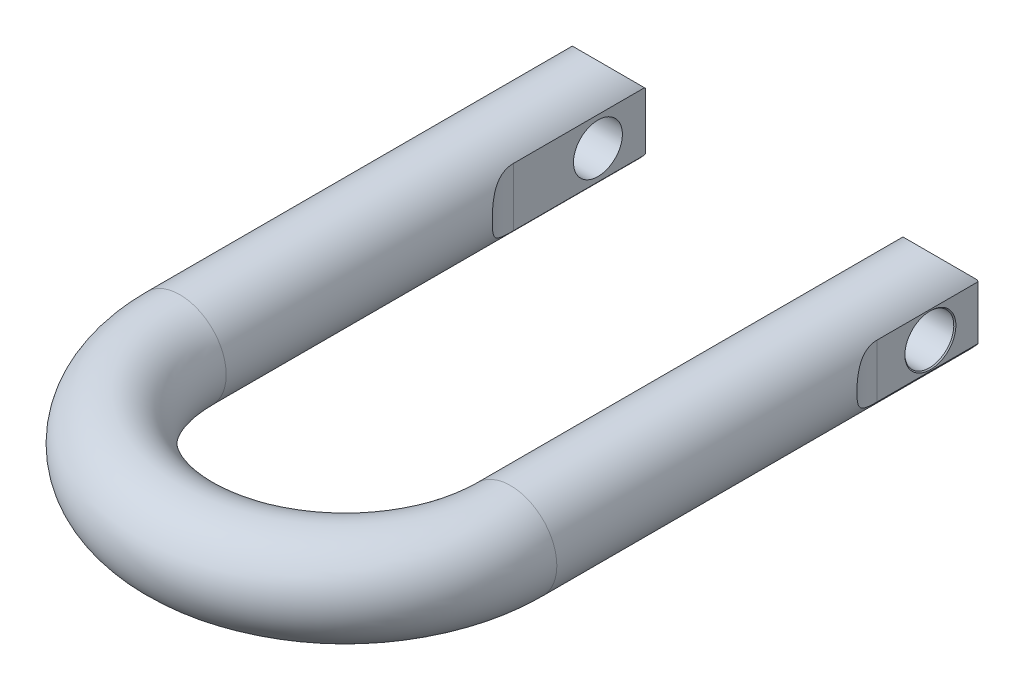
ISO-10303-21;
HEADER;
FILE_DESCRIPTION(('STEP AP214'),'2;1');
FILE_NAME('part.step','',(''),(''),'','','');
FILE_SCHEMA(('AUTOMOTIVE_DESIGN { 1 0 10303 214 1 1 1 1 }'));
ENDSEC;
DATA;
#1=APPLICATION_CONTEXT('core data for automotive mechanical design processes');
#2=APPLICATION_PROTOCOL_DEFINITION('international standard','automotive_design',2000,#1);
#3=PRODUCT_CONTEXT('',#1,'mechanical');
#4=PRODUCT('Part','Part','',(#3));
#5=PRODUCT_RELATED_PRODUCT_CATEGORY('part','',(#4));
#6=PRODUCT_DEFINITION_FORMATION('','',#4);
#7=PRODUCT_DEFINITION_CONTEXT('part definition',#1,'design');
#8=PRODUCT_DEFINITION('design','',#6,#7);
#9=PRODUCT_DEFINITION_SHAPE('','',#8);
#10=(LENGTH_UNIT() NAMED_UNIT(*) SI_UNIT(.MILLI.,.METRE.));
#11=(NAMED_UNIT(*) PLANE_ANGLE_UNIT() SI_UNIT($,.RADIAN.));
#12=(NAMED_UNIT(*) SI_UNIT($,.STERADIAN.) SOLID_ANGLE_UNIT());
#13=UNCERTAINTY_MEASURE_WITH_UNIT(LENGTH_MEASURE(1.E-05),#10,'distance_accuracy_value','');
#14=(GEOMETRIC_REPRESENTATION_CONTEXT(3) GLOBAL_UNCERTAINTY_ASSIGNED_CONTEXT((#13)) GLOBAL_UNIT_ASSIGNED_CONTEXT((#10,
#11,#12)) REPRESENTATION_CONTEXT('',''));
#15=CARTESIAN_POINT('',(0.,0.,0.));
#16=DIRECTION('',(0.,0.,1.));
#17=DIRECTION('',(1.,0.,0.));
#18=AXIS2_PLACEMENT_3D('',#15,#16,#17);
#19=CARTESIAN_POINT('',(97.5106,0.,0.));
#20=DIRECTION('',(1.,0.,0.));
#21=DIRECTION('',(0.,1.,0.));
#22=AXIS2_PLACEMENT_3D('',#19,#20,#21);
#23=CONICAL_SURFACE('',#22,12.2555,0.785398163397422);
#24=CARTESIAN_POINT('',(97.0051,0.,0.));
#25=DIRECTION('',(1.,0.,0.));
#26=DIRECTION('',(0.,1.,0.));
#27=AXIS2_PLACEMENT_3D('',#24,#25,#26);
#28=CIRCLE('',#27,11.75);
#29=CARTESIAN_POINT('',(97.0051,11.75,0.));
#30=VERTEX_POINT('',#29);
#31=EDGE_CURVE('E107',#30,#30,#28,.F.);
#32=ORIENTED_EDGE('',*,*,#31,.T.);
#33=EDGE_LOOP('',(#32));
#34=FACE_BOUND('',#33,.T.);
#35=CARTESIAN_POINT('',(97.5106,0.,0.));
#36=DIRECTION('',(1.,0.,0.));
#37=DIRECTION('',(0.,1.,0.));
#38=AXIS2_PLACEMENT_3D('',#35,#36,#37);
#39=CIRCLE('',#38,12.2555);
#40=CARTESIAN_POINT('',(97.5106,12.2555,0.));
#41=VERTEX_POINT('',#40);
#42=EDGE_CURVE('E116',#41,#41,#39,.T.);
#43=ORIENTED_EDGE('',*,*,#42,.T.);
#44=EDGE_LOOP('',(#43));
#45=FACE_BOUND('',#44,.T.);
#46=ADVANCED_FACE('F14',(#34,#45),#23,.F.);
#47=CARTESIAN_POINT('',(79.3877,0.,-22.8727));
#48=DIRECTION('',(0.,0.,1.));
#49=DIRECTION('',(-1.,0.,0.));
#50=AXIS2_PLACEMENT_3D('',#47,#48,#49);
#51=PLANE('',#50);
#52=DIRECTION('',(0.,-1.,0.));
#53=VECTOR('',#52,1.);
#54=CARTESIAN_POINT('',(97.5106,38.0238,-22.8727));
#55=LINE('',#54,#53);
#56=CARTESIAN_POINT('',(97.5106,12.8651125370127,-22.8727));
#57=VERTEX_POINT('',#56);
#58=CARTESIAN_POINT('',(97.5106,-12.8651125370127,-22.8727));
#59=VERTEX_POINT('',#58);
#60=EDGE_CURVE('E109',#57,#59,#55,.T.);
#61=ORIENTED_EDGE('',*,*,#60,.T.);
#62=CARTESIAN_POINT('',(79.3877,0.,-22.8727));
#63=DIRECTION('',(0.,0.,-1.));
#64=DIRECTION('',(1.,0.,0.));
#65=AXIS2_PLACEMENT_3D('',#62,#63,#64);
#66=CIRCLE('',#65,22.225);
#67=CARTESIAN_POINT('',(97.0475226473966,-13.49375,-22.8727));
#68=VERTEX_POINT('',#67);
#69=EDGE_CURVE('E95',#68,#59,#66,.F.);
#70=ORIENTED_EDGE('',*,*,#69,.F.);
#71=DIRECTION('',(1.,0.,0.));
#72=VECTOR('',#71,1.);
#73=CARTESIAN_POINT('',(-135.3312,-13.49375,-22.8727));
#74=LINE('',#73,#72);
#75=CARTESIAN_POINT('',(62.1284,-13.49375,-22.8727));
#76=VERTEX_POINT('',#75);
#77=EDGE_CURVE('E142',#68,#76,#74,.F.);
#78=ORIENTED_EDGE('',*,*,#77,.T.);
#79=DIRECTION('',(0.,-1.,0.));
#80=VECTOR('',#79,1.);
#81=CARTESIAN_POINT('',(62.1284,38.0238,-22.8727));
#82=LINE('',#81,#80);
#83=CARTESIAN_POINT('',(62.1284,13.49375,-22.8727));
#84=VERTEX_POINT('',#83);
#85=EDGE_CURVE('E152',#76,#84,#82,.F.);
#86=ORIENTED_EDGE('',*,*,#85,.T.);
#87=DIRECTION('',(1.,0.,0.));
#88=VECTOR('',#87,1.);
#89=CARTESIAN_POINT('',(-135.3312,13.49375,-22.8727));
#90=LINE('',#89,#88);
#91=CARTESIAN_POINT('',(97.0475226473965,13.49375,-22.8727));
#92=VERTEX_POINT('',#91);
#93=EDGE_CURVE('E155',#84,#92,#90,.T.);
#94=ORIENTED_EDGE('',*,*,#93,.T.);
#95=CARTESIAN_POINT('',(79.3877,0.,-22.8727));
#96=DIRECTION('',(0.,0.,-1.));
#97=DIRECTION('',(1.,0.,0.));
#98=AXIS2_PLACEMENT_3D('',#95,#96,#97);
#99=CIRCLE('',#98,22.225);
#100=EDGE_CURVE('E106',#57,#92,#99,.F.);
#101=ORIENTED_EDGE('',*,*,#100,.F.);
#102=EDGE_LOOP('',(#61,#70,#78,#86,#94,#101));
#103=FACE_BOUND('',#102,.T.);
#104=ADVANCED_FACE('F110',(#103),#51,.F.);
#105=CARTESIAN_POINT('',(-135.3312,13.49375,-22.8727));
#106=DIRECTION('',(0.,-0.707106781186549,0.707106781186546));
#107=DIRECTION('',(0.,-0.707106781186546,-0.707106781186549));
#108=AXIS2_PLACEMENT_3D('',#105,#106,#107);
#109=PLANE('',#108);
#110=DIRECTION('',(0.,0.707106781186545,0.70710678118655));
#111=VECTOR('',#110,1.);
#112=CARTESIAN_POINT('',(62.1284,13.49375,-22.8727));
#113=LINE('',#112,#111);
#114=CARTESIAN_POINT('',(62.1284,14.0023993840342,-22.3640506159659));
#115=VERTEX_POINT('',#114);
#116=EDGE_CURVE('E150',#84,#115,#113,.T.);
#117=ORIENTED_EDGE('',*,*,#116,.T.);
#118=CARTESIAN_POINT('',(79.3877,0.,-36.36645));
#119=DIRECTION('',(0.,-0.707106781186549,0.707106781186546));
#120=DIRECTION('',(0.,-0.707106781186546,-0.707106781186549));
#121=AXIS2_PLACEMENT_3D('',#118,#119,#120);
#122=ELLIPSE('',#121,31.4308964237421,22.225);
#123=EDGE_CURVE('E136',#92,#115,#122,.T.);
#124=ORIENTED_EDGE('',*,*,#123,.F.);
#125=ORIENTED_EDGE('',*,*,#93,.F.);
#126=EDGE_LOOP('',(#117,#124,#125));
#127=FACE_BOUND('',#126,.T.);
#128=ADVANCED_FACE('F322',(#127),#109,.F.);
#129=CARTESIAN_POINT('',(36.7284,38.0238,40.6273));
#130=DIRECTION('',(0.,-1.,0.));
#131=DIRECTION('',(1.,0.,0.));
#132=AXIS2_PLACEMENT_3D('',#129,#130,#131);
#133=CYLINDRICAL_SURFACE('',#132,25.4);
#134=CARTESIAN_POINT('',(62.1284,14.0023993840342,40.6273));
#135=CARTESIAN_POINT('',(62.1284018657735,14.0023956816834,40.839196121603));
#136=CARTESIAN_POINT('',(62.1257477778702,13.9991310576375,41.0510694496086));
#137=CARTESIAN_POINT('',(62.1151508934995,13.9860564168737,41.4744837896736));
#138=CARTESIAN_POINT('',(62.1072080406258,13.9762463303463,41.6860247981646));
#139=CARTESIAN_POINT('',(62.0754817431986,13.9369633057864,42.3197019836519));
#140=CARTESIAN_POINT('',(62.0438005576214,13.8976376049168,42.7409028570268));
#141=CARTESIAN_POINT('',(61.9598449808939,13.7922087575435,43.5789125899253));
#142=CARTESIAN_POINT('',(61.9075190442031,13.7260385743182,43.9957077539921));
#143=CARTESIAN_POINT('',(61.7832706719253,13.5663160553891,44.8210531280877));
#144=CARTESIAN_POINT('',(61.7113493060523,13.472765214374,45.2296037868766));
#145=CARTESIAN_POINT('',(61.5492028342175,13.2573317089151,46.0363034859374));
#146=CARTESIAN_POINT('',(61.4589442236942,13.1353971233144,46.4344319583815));
#147=CARTESIAN_POINT('',(61.2621545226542,12.8624847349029,47.2164928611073));
#148=CARTESIAN_POINT('',(61.1556231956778,12.7115065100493,47.6004250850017));
#149=CARTESIAN_POINT('',(60.9289182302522,12.3799939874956,48.3505269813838));
#150=CARTESIAN_POINT('',(60.8087618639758,12.1994969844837,48.71671832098));
#151=CARTESIAN_POINT('',(60.5577258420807,11.8083305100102,49.4287615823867));
#152=CARTESIAN_POINT('',(60.4268466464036,11.5976623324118,49.7746143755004));
#153=CARTESIAN_POINT('',(60.1612579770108,11.1516896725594,50.4346737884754));
#154=CARTESIAN_POINT('',(60.0267252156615,10.9171299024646,50.7494542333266));
#155=CARTESIAN_POINT('',(59.7545087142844,10.4196344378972,51.3542901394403));
#156=CARTESIAN_POINT('',(59.616824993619,10.1566989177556,51.6443457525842));
#157=CARTESIAN_POINT('',(59.3422619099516,9.60345572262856,52.1974605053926));
#158=CARTESIAN_POINT('',(59.2053824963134,9.31314979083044,52.4605213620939));
#159=CARTESIAN_POINT('',(58.9364675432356,8.70675913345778,52.9578180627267));
#160=CARTESIAN_POINT('',(58.8044316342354,8.39067638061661,53.1920561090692));
#161=CARTESIAN_POINT('',(58.5596945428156,7.76202433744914,53.6122432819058));
#162=CARTESIAN_POINT('',(58.4462970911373,7.45132001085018,53.8005826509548));
#163=CARTESIAN_POINT('',(58.2297394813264,6.81213325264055,54.1511630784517));
#164=CARTESIAN_POINT('',(58.1265788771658,6.48365159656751,54.3134052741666));
#165=CARTESIAN_POINT('',(57.9330726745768,5.81136099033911,54.6113418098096));
#166=CARTESIAN_POINT('',(57.8427235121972,5.46755633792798,54.7470435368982));
#167=CARTESIAN_POINT('',(57.6769913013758,4.76710042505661,54.9917836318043));
#168=CARTESIAN_POINT('',(57.6016074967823,4.41044981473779,55.1008233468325));
#169=CARTESIAN_POINT('',(57.4741278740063,3.72239062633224,55.2828746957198));
#170=CARTESIAN_POINT('',(57.4204759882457,3.39192227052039,55.3583661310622));
#171=CARTESIAN_POINT('',(57.3277909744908,2.72478080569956,55.4876981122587));
#172=CARTESIAN_POINT('',(57.2887565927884,2.38810823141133,55.5415405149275));
#173=CARTESIAN_POINT('',(57.226015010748,1.71058350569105,55.6276540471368));
#174=CARTESIAN_POINT('',(57.2023087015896,1.36973111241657,55.6599239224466));
#175=CARTESIAN_POINT('',(57.170650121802,0.685923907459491,55.7029464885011));
#176=CARTESIAN_POINT('',(57.1626990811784,0.342968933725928,55.71369749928));
#177=CARTESIAN_POINT('',(57.162701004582,-0.374980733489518,55.7136970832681));
#178=CARTESIAN_POINT('',(57.1722076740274,-0.749978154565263,55.7008450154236));
#179=CARTESIAN_POINT('',(57.2100351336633,-1.49726337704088,55.6494046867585));
#180=CARTESIAN_POINT('',(57.2383570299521,-1.86955101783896,55.6108149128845));
#181=CARTESIAN_POINT('',(57.3132118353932,-2.60875890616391,55.5078097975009));
#182=CARTESIAN_POINT('',(57.3597481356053,-2.97567814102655,55.443389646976));
#183=CARTESIAN_POINT('',(57.470009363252,-3.70137249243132,55.2886320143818));
#184=CARTESIAN_POINT('',(57.533733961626,-4.06014776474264,55.1982950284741));
#185=CARTESIAN_POINT('',(57.6769592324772,-4.7670160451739,54.9916190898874));
#186=CARTESIAN_POINT('',(57.756464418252,-5.11510596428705,54.8752726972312));
#187=CARTESIAN_POINT('',(57.9294010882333,-5.79793747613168,54.6166435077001));
#188=CARTESIAN_POINT('',(58.0228325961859,-6.13267904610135,54.4743606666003));
#189=CARTESIAN_POINT('',(58.2213793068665,-6.78632010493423,54.1641284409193));
#190=CARTESIAN_POINT('',(58.326491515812,-7.10522362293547,53.9961856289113));
#191=CARTESIAN_POINT('',(58.5458742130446,-7.725090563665,53.6350830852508));
#192=CARTESIAN_POINT('',(58.6601445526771,-8.02605427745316,53.4419237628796));
#193=CARTESIAN_POINT('',(58.8929058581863,-8.60284905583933,53.0349029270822));
#194=CARTESIAN_POINT('',(59.0112820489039,-8.87903802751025,52.8214825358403));
#195=CARTESIAN_POINT('',(59.251373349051,-9.41085056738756,52.3721091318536));
#196=CARTESIAN_POINT('',(59.3730884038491,-9.66647447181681,52.1361564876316));
#197=CARTESIAN_POINT('',(59.6170219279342,-10.1560689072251,51.6430445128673));
#198=CARTESIAN_POINT('',(59.7392403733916,-10.390040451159,51.385886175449));
#199=CARTESIAN_POINT('',(59.9814226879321,-10.8356520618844,50.8519207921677));
#200=CARTESIAN_POINT('',(60.1013865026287,-11.0472915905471,50.5751132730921));
#201=CARTESIAN_POINT('',(60.3396487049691,-11.4533532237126,49.9958453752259));
#202=CARTESIAN_POINT('',(60.4578130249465,-11.6471503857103,49.6928920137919));
#203=CARTESIAN_POINT('',(60.6864373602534,-12.0108097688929,49.0701938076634));
#204=CARTESIAN_POINT('',(60.7968972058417,-12.1806714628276,48.7504485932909));
#205=CARTESIAN_POINT('',(61.0079311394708,-12.4968351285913,48.0960773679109));
#206=CARTESIAN_POINT('',(61.1084977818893,-12.6431194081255,47.7614404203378));
#207=CARTESIAN_POINT('',(61.2977268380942,-12.9124197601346,47.0796907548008));
#208=CARTESIAN_POINT('',(61.3863891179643,-13.0354355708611,46.7325778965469));
#209=CARTESIAN_POINT('',(61.5566148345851,-13.267454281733,46.0005415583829));
#210=CARTESIAN_POINT('',(61.6370859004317,-13.3746169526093,45.6147800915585));
#211=CARTESIAN_POINT('',(61.780801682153,-13.5632525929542,44.8338248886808));
#212=CARTESIAN_POINT('',(61.8440432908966,-13.644720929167,44.4386294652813));
#213=CARTESIAN_POINT('',(61.9520641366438,-13.7824843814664,43.6419596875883));
#214=CARTESIAN_POINT('',(61.9968677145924,-13.8388126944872,43.2404943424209));
#215=CARTESIAN_POINT('',(62.0673438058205,-13.9269196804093,42.433370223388));
#216=CARTESIAN_POINT('',(62.0930256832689,-13.9587103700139,42.0277136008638));
#217=CARTESIAN_POINT('',(62.1154312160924,-13.9864014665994,41.4556384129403));
#218=CARTESIAN_POINT('',(62.1202964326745,-13.9924060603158,41.2899450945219));
#219=CARTESIAN_POINT('',(62.1267788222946,-14.0004017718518,40.9586064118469));
#220=CARTESIAN_POINT('',(62.1284000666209,-14.0023979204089,40.7929612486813));
#221=CARTESIAN_POINT('',(62.1284,-14.0023993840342,40.6273));
#222=B_SPLINE_CURVE_WITH_KNOTS('',3,(#134,#135,#136,#137,#138,#139,#140,#141,#142,#143,#144,
#145,#146,#147,#148,#149,#150,#151,#152,#153,#154,#155,#156,#157,#158,#159,#160,#161,#162,#163,
#164,#165,#166,#167,#168,#169,#170,#171,#172,#173,#174,#175,#176,#177,#178,#179,#180,#181,#182,
#183,#184,#185,#186,#187,#188,#189,#190,#191,#192,#193,#194,#195,#196,#197,#198,#199,#200,#201,
#202,#203,#204,#205,#206,#207,#208,#209,#210,#211,#212,#213,#214,#215,#216,#217,#218,#219,#220,
#221),.UNSPECIFIED.,.F.,.F.,(4,2,2,2,2,2,2,2,2,2,2,2,2,2,2,2,2,2,2,2,2,2,2,2,2,2,2,2,2,2,2,2,2,
2,2,2,2,2,2,2,2,2,2,4),(0.,0.635600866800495,1.27120851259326,2.5423922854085,3.81677022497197,
5.09107861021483,6.36773660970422,7.64441316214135,8.91948901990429,10.194510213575,
11.437759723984,12.6810015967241,13.9241643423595,15.1672320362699,16.307657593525,
17.448033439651,18.5880914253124,19.7280917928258,20.7566619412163,21.7851438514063,
22.8136855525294,23.8423075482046,24.9669383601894,26.0916352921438,27.2165417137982,
28.3414266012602,29.4666336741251,30.5918426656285,31.7167639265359,32.841666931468,
33.9460820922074,35.0504791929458,36.1548246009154,37.2591966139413,38.3936094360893,
39.5280472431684,40.6633323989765,41.798630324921,43.0224402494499,44.2464707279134,
45.4688800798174,46.6906904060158,47.1882468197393,47.6851783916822),.UNSPECIFIED.);
#223=CARTESIAN_POINT('',(62.1284,14.0023993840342,40.6273));
#224=VERTEX_POINT('',#223);
#225=CARTESIAN_POINT('',(62.1284,-14.0023993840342,40.6273));
#226=VERTEX_POINT('',#225);
#227=EDGE_CURVE('E132',#224,#226,#222,.T.);
#228=ORIENTED_EDGE('',*,*,#227,.F.);
#229=DIRECTION('',(0.,-1.,0.));
#230=VECTOR('',#229,1.);
#231=CARTESIAN_POINT('',(62.1284,38.0238,40.6273));
#232=LINE('',#231,#230);
#233=EDGE_CURVE('E146',#224,#226,#232,.T.);
#234=ORIENTED_EDGE('',*,*,#233,.T.);
#235=EDGE_LOOP('',(#228,#234));
#236=FACE_BOUND('',#235,.T.);
#237=ADVANCED_FACE('F344',(#236),#133,.F.);
#238=CARTESIAN_POINT('',(62.1284,38.0238,40.6273));
#239=DIRECTION('',(1.,0.,0.));
#240=DIRECTION('',(0.,0.,1.));
#241=AXIS2_PLACEMENT_3D('',#238,#239,#240);
#242=PLANE('',#241);
#243=CARTESIAN_POINT('',(62.1284,0.,0.));
#244=DIRECTION('',(1.,0.,0.));
#245=DIRECTION('',(0.,0.,1.));
#246=AXIS2_PLACEMENT_3D('',#243,#244,#245);
#247=CIRCLE('',#246,11.75);
#248=CARTESIAN_POINT('',(62.1284,0.,11.75));
#249=VERTEX_POINT('',#248);
#250=EDGE_CURVE('E375',#249,#249,#247,.T.);
#251=ORIENTED_EDGE('',*,*,#250,.T.);
#252=EDGE_LOOP('',(#251));
#253=FACE_BOUND('',#252,.T.);
#254=DIRECTION('',(0.,0.,-1.));
#255=VECTOR('',#254,1.);
#256=CARTESIAN_POINT('',(62.1284,14.0023993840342,183.4769));
#257=LINE('',#256,#255);
#258=EDGE_CURVE('E133',#115,#224,#257,.F.);
#259=ORIENTED_EDGE('',*,*,#258,.F.);
#260=ORIENTED_EDGE('',*,*,#116,.F.);
#261=ORIENTED_EDGE('',*,*,#85,.F.);
#262=DIRECTION('',(0.,-0.707106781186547,0.707106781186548));
#263=VECTOR('',#262,1.);
#264=CARTESIAN_POINT('',(62.1284,-22.225,-14.14145));
#265=LINE('',#264,#263);
#266=CARTESIAN_POINT('',(62.1284,-14.0023993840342,-22.3640506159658));
#267=VERTEX_POINT('',#266);
#268=EDGE_CURVE('E140',#76,#267,#265,.T.);
#269=ORIENTED_EDGE('',*,*,#268,.T.);
#270=DIRECTION('',(0.,0.,-1.));
#271=VECTOR('',#270,1.);
#272=CARTESIAN_POINT('',(62.1284,-14.0023993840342,183.4769));
#273=LINE('',#272,#271);
#274=EDGE_CURVE('E126',#226,#267,#273,.T.);
#275=ORIENTED_EDGE('',*,*,#274,.F.);
#276=ORIENTED_EDGE('',*,*,#233,.F.);
#277=EDGE_LOOP('',(#259,#260,#261,#269,#275,#276));
#278=FACE_BOUND('',#277,.T.);
#279=ADVANCED_FACE('F325',(#253,#278),#242,.F.);
#280=CARTESIAN_POINT('',(-135.3312,-22.225,-14.14145));
#281=DIRECTION('',(0.,0.707106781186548,0.707106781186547));
#282=DIRECTION('',(0.,-0.707106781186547,0.707106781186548));
#283=AXIS2_PLACEMENT_3D('',#280,#281,#282);
#284=PLANE('',#283);
#285=ORIENTED_EDGE('',*,*,#268,.F.);
#286=ORIENTED_EDGE('',*,*,#77,.F.);
#287=CARTESIAN_POINT('',(79.3877,0.,-36.36645));
#288=DIRECTION('',(0.,0.707106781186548,0.707106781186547));
#289=DIRECTION('',(0.,0.707106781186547,-0.707106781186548));
#290=AXIS2_PLACEMENT_3D('',#287,#288,#289);
#291=ELLIPSE('',#290,31.430896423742,22.225);
#292=EDGE_CURVE('E105',#267,#68,#291,.T.);
#293=ORIENTED_EDGE('',*,*,#292,.F.);
#294=EDGE_LOOP('',(#285,#286,#293));
#295=FACE_BOUND('',#294,.T.);
#296=ADVANCED_FACE('F335',(#295),#284,.F.);
#297=CARTESIAN_POINT('',(97.5106,38.0238,-81.8679758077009));
#298=DIRECTION('',(-1.,0.,0.));
#299=DIRECTION('',(0.,0.,-1.));
#300=AXIS2_PLACEMENT_3D('',#297,#298,#299);
#301=PLANE('',#300);
#302=DIRECTION('',(0.,0.,-1.));
#303=VECTOR('',#302,1.);
#304=CARTESIAN_POINT('',(97.5106,-12.8651125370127,183.4769));
#305=LINE('',#304,#303);
#306=CARTESIAN_POINT('',(97.5106,-12.8651125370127,25.5397));
#307=VERTEX_POINT('',#306);
#308=EDGE_CURVE('E102',#59,#307,#305,.F.);
#309=ORIENTED_EDGE('',*,*,#308,.F.);
#310=ORIENTED_EDGE('',*,*,#60,.F.);
#311=DIRECTION('',(0.,0.,-1.));
#312=VECTOR('',#311,1.);
#313=CARTESIAN_POINT('',(97.5106,12.8651125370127,183.4769));
#314=LINE('',#313,#312);
#315=CARTESIAN_POINT('',(97.5106,12.8651125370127,25.5397));
#316=VERTEX_POINT('',#315);
#317=EDGE_CURVE('E137',#316,#57,#314,.T.);
#318=ORIENTED_EDGE('',*,*,#317,.F.);
#319=DIRECTION('',(0.,-1.,0.));
#320=VECTOR('',#319,1.);
#321=CARTESIAN_POINT('',(97.5106,38.0238,25.5397));
#322=LINE('',#321,#320);
#323=EDGE_CURVE('E115',#316,#307,#322,.T.);
#324=ORIENTED_EDGE('',*,*,#323,.T.);
#325=EDGE_LOOP('',(#309,#310,#318,#324));
#326=FACE_BOUND('',#325,.T.);
#327=ORIENTED_EDGE('',*,*,#42,.F.);
#328=EDGE_LOOP('',(#327));
#329=FACE_BOUND('',#328,.T.);
#330=ADVANCED_FACE('F118',(#326,#329),#301,.F.);
#331=CARTESIAN_POINT('',(122.9106,38.0238,25.5397));
#332=DIRECTION('',(0.,-1.,0.));
#333=DIRECTION('',(1.,0.,0.));
#334=AXIS2_PLACEMENT_3D('',#331,#332,#333);
#335=CYLINDRICAL_SURFACE('',#334,25.4);
#336=ORIENTED_EDGE('',*,*,#323,.F.);
#337=CARTESIAN_POINT('',(97.5106,-12.8651125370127,25.5397));
#338=CARTESIAN_POINT('',(97.5105982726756,-12.8651095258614,25.7337569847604));
#339=CARTESIAN_POINT('',(97.5128244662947,-12.8619796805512,25.9277932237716));
#340=CARTESIAN_POINT('',(97.5217118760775,-12.8494483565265,26.3155631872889));
#341=CARTESIAN_POINT('',(97.5283731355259,-12.8400468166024,26.509296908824));
#342=CARTESIAN_POINT('',(97.5549775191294,-12.8024087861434,27.0896318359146));
#343=CARTESIAN_POINT('',(97.5815412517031,-12.7647388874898,27.4753821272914));
#344=CARTESIAN_POINT('',(97.6518956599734,-12.6638679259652,28.242792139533));
#345=CARTESIAN_POINT('',(97.695724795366,-12.6006098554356,28.6244407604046));
#346=CARTESIAN_POINT('',(97.7997336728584,-12.4481387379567,29.3802562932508));
#347=CARTESIAN_POINT('',(97.8599125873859,-12.3589270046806,29.754423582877));
#348=CARTESIAN_POINT('',(97.9954775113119,-12.153862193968,30.4932827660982));
#349=CARTESIAN_POINT('',(98.0708891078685,-12.0379642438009,30.8579575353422));
#350=CARTESIAN_POINT('',(98.2351727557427,-11.7790867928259,31.5744638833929));
#351=CARTESIAN_POINT('',(98.3240449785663,-11.6361069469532,31.9262952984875));
#352=CARTESIAN_POINT('',(98.5130204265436,-11.3228156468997,32.6139575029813));
#353=CARTESIAN_POINT('',(98.6131111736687,-11.1525344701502,32.9498054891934));
#354=CARTESIAN_POINT('',(98.8220430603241,-10.7843272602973,33.6031388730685));
#355=CARTESIAN_POINT('',(98.9308839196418,-10.5864021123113,33.9206248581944));
#356=CARTESIAN_POINT('',(99.1525881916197,-10.1663804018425,34.5297095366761));
#357=CARTESIAN_POINT('',(99.2653612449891,-9.94471365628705,34.8216372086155));
#358=CARTESIAN_POINT('',(99.4933604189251,-9.47528862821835,35.3826976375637));
#359=CARTESIAN_POINT('',(99.6085865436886,-9.22753030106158,35.6518303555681));
#360=CARTESIAN_POINT('',(99.8381270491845,-8.70698253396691,36.1651444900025));
#361=CARTESIAN_POINT('',(99.9524414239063,-8.43419292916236,36.409325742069));
#362=CARTESIAN_POINT('',(100.176712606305,-7.8651790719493,36.8709061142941));
#363=CARTESIAN_POINT('',(100.286669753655,-7.56895665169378,37.0883073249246));
#364=CARTESIAN_POINT('',(100.490533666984,-6.97929606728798,37.4789340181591));
#365=CARTESIAN_POINT('',(100.585022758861,-6.68746637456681,37.6542879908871));
#366=CARTESIAN_POINT('',(100.765003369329,-6.08765437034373,37.9802478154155));
#367=CARTESIAN_POINT('',(100.850495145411,-5.77967252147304,38.130854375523));
#368=CARTESIAN_POINT('',(101.010236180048,-5.14995348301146,38.4066915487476));
#369=CARTESIAN_POINT('',(101.08449126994,-4.82822354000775,38.5319353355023));
#370=CARTESIAN_POINT('',(101.219926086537,-4.17328455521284,38.7568070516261));
#371=CARTESIAN_POINT('',(101.281107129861,-3.84007667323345,38.856437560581));
#372=CARTESIAN_POINT('',(101.38021815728,-3.21903500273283,39.015974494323));
#373=CARTESIAN_POINT('',(101.420304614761,-2.93251447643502,39.0796916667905));
#374=CARTESIAN_POINT('',(101.489533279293,-2.35462953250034,39.1889525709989));
#375=CARTESIAN_POINT('',(101.518672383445,-2.06326376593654,39.2344911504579));
#376=CARTESIAN_POINT('',(101.56549269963,-1.47733460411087,39.3073531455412));
#377=CARTESIAN_POINT('',(101.583173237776,-1.18277102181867,39.3346754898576));
#378=CARTESIAN_POINT('',(101.606775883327,-0.592144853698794,39.3710968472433));
#379=CARTESIAN_POINT('',(101.612701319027,-0.296082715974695,39.3802010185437));
#380=CARTESIAN_POINT('',(101.612698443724,0.349338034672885,39.3802000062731));
#381=CARTESIAN_POINT('',(101.60444634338,0.698704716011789,39.3675250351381));
#382=CARTESIAN_POINT('',(101.57162422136,1.39484571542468,39.3168190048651));
#383=CARTESIAN_POINT('',(101.547052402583,1.74161974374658,39.2787851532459));
#384=CARTESIAN_POINT('',(101.482153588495,2.43008917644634,39.1773430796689));
#385=CARTESIAN_POINT('',(101.441820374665,2.77178252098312,39.113924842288));
#386=CARTESIAN_POINT('',(101.346359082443,3.44736086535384,38.9617553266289));
#387=CARTESIAN_POINT('',(101.291231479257,3.78124611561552,38.873004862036));
#388=CARTESIAN_POINT('',(101.167521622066,4.43867856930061,38.6702988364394));
#389=CARTESIAN_POINT('',(101.098940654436,4.76222675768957,38.5563456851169));
#390=CARTESIAN_POINT('',(100.950012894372,5.39661487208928,38.3034817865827));
#391=CARTESIAN_POINT('',(100.869666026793,5.70745471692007,38.1645708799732));
#392=CARTESIAN_POINT('',(100.699246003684,6.31410209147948,37.8622740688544));
#393=CARTESIAN_POINT('',(100.609175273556,6.60991334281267,37.6988942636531));
#394=CARTESIAN_POINT('',(100.421579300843,7.18456054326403,37.3483174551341));
#395=CARTESIAN_POINT('',(100.324054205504,7.46339682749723,37.1611209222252));
#396=CARTESIAN_POINT('',(100.12652481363,7.99564595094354,36.7688104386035));
#397=CARTESIAN_POINT('',(100.026642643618,8.24951883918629,36.5642584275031));
#398=CARTESIAN_POINT('',(99.824549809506,8.73817595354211,36.1345404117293));
#399=CARTESIAN_POINT('',(99.7223390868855,8.97295969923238,35.9093738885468));
#400=CARTESIAN_POINT('',(99.518026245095,9.42239516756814,35.4398520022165));
#401=CARTESIAN_POINT('',(99.4159241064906,9.63705146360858,35.1955010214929));
#402=CARTESIAN_POINT('',(99.2141371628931,10.04564334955,34.6891223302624));
#403=CARTESIAN_POINT('',(99.1144524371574,10.239578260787,34.4270940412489));
#404=CARTESIAN_POINT('',(98.9162960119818,10.6127638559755,33.8776605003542));
#405=CARTESIAN_POINT('',(98.8179875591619,10.7912675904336,33.5896891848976));
#406=CARTESIAN_POINT('',(98.6285018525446,11.1256059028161,32.9986558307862));
#407=CARTESIAN_POINT('',(98.5373246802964,11.2814402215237,32.6955936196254));
#408=CARTESIAN_POINT('',(98.3639158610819,11.5707540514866,32.0760511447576));
#409=CARTESIAN_POINT('',(98.2816951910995,11.7042062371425,31.7595550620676));
#410=CARTESIAN_POINT('',(98.1279533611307,11.9488239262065,31.1155468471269));
#411=CARTESIAN_POINT('',(98.0564329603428,12.0599878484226,30.7880339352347));
#412=CARTESIAN_POINT('',(97.9133499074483,12.2788883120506,30.0627563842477));
#413=CARTESIAN_POINT('',(97.8442110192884,12.3822135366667,29.6631731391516));
#414=CARTESIAN_POINT('',(97.7245251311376,12.5587751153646,28.8546324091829));
#415=CARTESIAN_POINT('',(97.6739827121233,12.6320040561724,28.4456726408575));
#416=CARTESIAN_POINT('',(97.5927145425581,12.7488494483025,27.6219387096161));
#417=CARTESIAN_POINT('',(97.5619705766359,12.7924931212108,27.2071702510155));
#418=CARTESIAN_POINT('',(97.5311762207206,12.8360882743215,26.5829270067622));
#419=CARTESIAN_POINT('',(97.5234650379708,12.8469749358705,26.3745123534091));
#420=CARTESIAN_POINT('',(97.513175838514,12.8614849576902,25.9573071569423));
#421=CARTESIAN_POINT('',(97.5105977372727,12.8651084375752,25.7485166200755));
#422=CARTESIAN_POINT('',(97.5106,12.8651125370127,25.5397));
#423=B_SPLINE_CURVE_WITH_KNOTS('',3,(#337,#338,#339,#340,#341,#342,#343,#344,#345,#346,#347,
#348,#349,#350,#351,#352,#353,#354,#355,#356,#357,#358,#359,#360,#361,#362,#363,#364,#365,#366,
#367,#368,#369,#370,#371,#372,#373,#374,#375,#376,#377,#378,#379,#380,#381,#382,#383,#384,#385,
#386,#387,#388,#389,#390,#391,#392,#393,#394,#395,#396,#397,#398,#399,#400,#401,#402,#403,#404,
#405,#406,#407,#408,#409,#410,#411,#412,#413,#414,#415,#416,#417,#418,#419,#420,#421,#422),
.UNSPECIFIED.,.F.,.F.,(4,2,2,2,2,2,2,2,2,2,2,2,2,2,2,2,2,2,2,2,2,2,2,2,2,2,2,2,2,2,2,2,2,2,2,2,
2,2,2,2,2,2,4),(0.,0.582091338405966,1.16418835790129,2.32833655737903,3.49509276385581,
4.6617899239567,5.83046339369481,6.99915175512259,8.16655288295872,9.33391664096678,
10.4828936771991,11.6318726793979,12.7808592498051,13.9297560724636,14.9884214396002,
16.0470565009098,17.1051402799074,18.1631174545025,19.0510784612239,19.9392909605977,
20.8275556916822,21.7155688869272,22.7633057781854,23.8111580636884,24.8594241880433,
25.9076566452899,26.9557889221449,28.0039278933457,29.0518060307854,30.099663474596,
31.1214395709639,32.1432413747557,33.1648104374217,34.186412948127,35.2436062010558,
36.3008115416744,37.35929833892,38.4178602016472,39.6716056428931,40.925659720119,
42.1785583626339,42.8049188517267,43.4312690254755),.UNSPECIFIED.);
#424=EDGE_CURVE('E122',#307,#316,#423,.T.);
#425=ORIENTED_EDGE('',*,*,#424,.F.);
#426=EDGE_LOOP('',(#336,#425));
#427=FACE_BOUND('',#426,.T.);
#428=ADVANCED_FACE('F247',(#427),#335,.F.);
#429=CARTESIAN_POINT('',(79.3877,0.,183.4769));
#430=DIRECTION('',(0.,0.,-1.));
#431=DIRECTION('',(1.,0.,0.));
#432=AXIS2_PLACEMENT_3D('',#429,#430,#431);
#433=CYLINDRICAL_SURFACE('',#432,22.225);
#434=CARTESIAN_POINT('',(79.3877,0.,183.4769));
#435=DIRECTION('',(0.,0.,-1.));
#436=DIRECTION('',(1.,0.,0.));
#437=AXIS2_PLACEMENT_3D('',#434,#435,#436);
#438=CIRCLE('',#437,22.225);
#439=CARTESIAN_POINT('',(101.6127,0.,183.4769));
#440=VERTEX_POINT('',#439);
#441=EDGE_CURVE('E124',#440,#440,#438,.F.);
#442=ORIENTED_EDGE('',*,*,#441,.F.);
#443=EDGE_LOOP('',(#442));
#444=FACE_BOUND('',#443,.T.);
#445=ORIENTED_EDGE('',*,*,#308,.T.);
#446=ORIENTED_EDGE('',*,*,#424,.T.);
#447=ORIENTED_EDGE('',*,*,#317,.T.);
#448=ORIENTED_EDGE('',*,*,#100,.T.);
#449=ORIENTED_EDGE('',*,*,#123,.T.);
#450=ORIENTED_EDGE('',*,*,#258,.T.);
#451=ORIENTED_EDGE('',*,*,#227,.T.);
#452=ORIENTED_EDGE('',*,*,#274,.T.);
#453=ORIENTED_EDGE('',*,*,#292,.T.);
#454=ORIENTED_EDGE('',*,*,#69,.T.);
#455=EDGE_LOOP('',(#445,#446,#447,#448,#449,#450,#451,#452,#453,#454));
#456=FACE_BOUND('',#455,.T.);
#457=ADVANCED_FACE('F100',(#444,#456),#433,.T.);
#458=CARTESIAN_POINT('',(-135.3312,13.49375,-22.8727));
#459=DIRECTION('',(0.,-0.707106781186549,0.707106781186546));
#460=DIRECTION('',(0.,-0.707106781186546,-0.707106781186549));
#461=AXIS2_PLACEMENT_3D('',#458,#459,#460);
#462=PLANE('',#461);
#463=DIRECTION('',(0.,-0.707106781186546,-0.707106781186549));
#464=VECTOR('',#463,1.);
#465=CARTESIAN_POINT('',(-62.1284,13.49375,-22.8727));
#466=LINE('',#465,#464);
#467=CARTESIAN_POINT('',(-62.1284,13.49375,-22.8727));
#468=VERTEX_POINT('',#467);
#469=CARTESIAN_POINT('',(-62.1284,14.0023993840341,-22.364050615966));
#470=VERTEX_POINT('',#469);
#471=EDGE_CURVE('E230',#468,#470,#466,.F.);
#472=ORIENTED_EDGE('',*,*,#471,.F.);
#473=DIRECTION('',(1.,0.,0.));
#474=VECTOR('',#473,1.);
#475=CARTESIAN_POINT('',(-79.3877,13.49375,-22.8727));
#476=LINE('',#475,#474);
#477=CARTESIAN_POINT('',(-97.0475226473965,13.49375,-22.8727));
#478=VERTEX_POINT('',#477);
#479=EDGE_CURVE('E226',#478,#468,#476,.T.);
#480=ORIENTED_EDGE('',*,*,#479,.F.);
#481=CARTESIAN_POINT('',(-79.3877,0.,-36.36645));
#482=DIRECTION('',(0.,-0.707106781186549,0.707106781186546));
#483=DIRECTION('',(0.,-0.707106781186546,-0.707106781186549));
#484=AXIS2_PLACEMENT_3D('',#481,#482,#483);
#485=ELLIPSE('',#484,31.4308964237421,22.225);
#486=EDGE_CURVE('E277',#470,#478,#485,.T.);
#487=ORIENTED_EDGE('',*,*,#486,.F.);
#488=EDGE_LOOP('',(#472,#480,#487));
#489=FACE_BOUND('',#488,.T.);
#490=ADVANCED_FACE('F246',(#489),#462,.F.);
#491=CARTESIAN_POINT('',(-97.5106,0.,0.));
#492=DIRECTION('',(-1.,0.,0.));
#493=DIRECTION('',(0.,0.,-1.));
#494=AXIS2_PLACEMENT_3D('',#491,#492,#493);
#495=CONICAL_SURFACE('',#494,12.2555,0.785398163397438);
#496=CARTESIAN_POINT('',(-97.0051,0.,0.));
#497=DIRECTION('',(-1.,0.,0.));
#498=DIRECTION('',(0.,0.,-1.));
#499=AXIS2_PLACEMENT_3D('',#496,#497,#498);
#500=CIRCLE('',#499,11.75);
#501=CARTESIAN_POINT('',(-97.0051,0.,-11.75));
#502=VERTEX_POINT('',#501);
#503=EDGE_CURVE('E373',#502,#502,#500,.F.);
#504=ORIENTED_EDGE('',*,*,#503,.T.);
#505=EDGE_LOOP('',(#504));
#506=FACE_BOUND('',#505,.T.);
#507=CARTESIAN_POINT('',(-97.5106,0.,0.));
#508=DIRECTION('',(-1.,0.,0.));
#509=DIRECTION('',(0.,0.,-1.));
#510=AXIS2_PLACEMENT_3D('',#507,#508,#509);
#511=CIRCLE('',#510,12.2555);
#512=CARTESIAN_POINT('',(-97.5106,0.,-12.2555));
#513=VERTEX_POINT('',#512);
#514=EDGE_CURVE('E192',#513,#513,#511,.T.);
#515=ORIENTED_EDGE('',*,*,#514,.T.);
#516=EDGE_LOOP('',(#515));
#517=FACE_BOUND('',#516,.T.);
#518=ADVANCED_FACE('F255',(#506,#517),#495,.F.);
#519=CARTESIAN_POINT('',(-79.3877,0.,-22.8727));
#520=DIRECTION('',(0.,0.,-1.));
#521=DIRECTION('',(1.,0.,0.));
#522=AXIS2_PLACEMENT_3D('',#519,#520,#521);
#523=PLANE('',#522);
#524=DIRECTION('',(1.,0.,0.));
#525=VECTOR('',#524,1.);
#526=CARTESIAN_POINT('',(-135.3312,-13.49375,-22.8727));
#527=LINE('',#526,#525);
#528=CARTESIAN_POINT('',(-62.1284,-13.49375,-22.8727));
#529=VERTEX_POINT('',#528);
#530=CARTESIAN_POINT('',(-97.0475226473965,-13.49375,-22.8727));
#531=VERTEX_POINT('',#530);
#532=EDGE_CURVE('E220',#529,#531,#527,.F.);
#533=ORIENTED_EDGE('',*,*,#532,.T.);
#534=CARTESIAN_POINT('',(-79.3877,0.,-22.8727));
#535=DIRECTION('',(0.,0.,-1.));
#536=DIRECTION('',(1.,0.,0.));
#537=AXIS2_PLACEMENT_3D('',#534,#535,#536);
#538=CIRCLE('',#537,22.225);
#539=CARTESIAN_POINT('',(-97.5106,-12.8651125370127,-22.8727));
#540=VERTEX_POINT('',#539);
#541=EDGE_CURVE('E229',#531,#540,#538,.T.);
#542=ORIENTED_EDGE('',*,*,#541,.T.);
#543=DIRECTION('',(0.,1.,0.));
#544=VECTOR('',#543,1.);
#545=CARTESIAN_POINT('',(-97.5106,38.0238,-22.8727));
#546=LINE('',#545,#544);
#547=CARTESIAN_POINT('',(-97.5106,12.8651125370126,-22.8727));
#548=VERTEX_POINT('',#547);
#549=EDGE_CURVE('E212',#540,#548,#546,.T.);
#550=ORIENTED_EDGE('',*,*,#549,.T.);
#551=CARTESIAN_POINT('',(-79.3877,0.,-22.8727));
#552=DIRECTION('',(0.,0.,-1.));
#553=DIRECTION('',(1.,0.,0.));
#554=AXIS2_PLACEMENT_3D('',#551,#552,#553);
#555=CIRCLE('',#554,22.225);
#556=EDGE_CURVE('E279',#478,#548,#555,.F.);
#557=ORIENTED_EDGE('',*,*,#556,.F.);
#558=ORIENTED_EDGE('',*,*,#479,.T.);
#559=DIRECTION('',(0.,-1.,0.));
#560=VECTOR('',#559,1.);
#561=CARTESIAN_POINT('',(-62.1284,38.0238,-22.8727));
#562=LINE('',#561,#560);
#563=EDGE_CURVE('E219',#468,#529,#562,.T.);
#564=ORIENTED_EDGE('',*,*,#563,.T.);
#565=EDGE_LOOP('',(#533,#542,#550,#557,#558,#564));
#566=FACE_BOUND('',#565,.T.);
#567=ADVANCED_FACE('F206',(#566),#523,.T.);
#568=CARTESIAN_POINT('',(0.,0.,183.4769));
#569=DIRECTION('',(0.,1.,0.));
#570=DIRECTION('',(-1.,0.,0.));
#571=AXIS2_PLACEMENT_3D('',#568,#569,#570);
#572=TOROIDAL_SURFACE('',#571,79.3877,22.225);
#573=ORIENTED_EDGE('',*,*,#441,.T.);
#574=EDGE_LOOP('',(#573));
#575=FACE_BOUND('',#574,.T.);
#576=CARTESIAN_POINT('',(-79.3877,0.,183.4769));
#577=DIRECTION('',(0.,0.,-1.));
#578=DIRECTION('',(1.,0.,0.));
#579=AXIS2_PLACEMENT_3D('',#576,#577,#578);
#580=CIRCLE('',#579,22.225);
#581=CARTESIAN_POINT('',(-57.1627,0.,183.4769));
#582=VERTEX_POINT('',#581);
#583=EDGE_CURVE('E191',#582,#582,#580,.T.);
#584=ORIENTED_EDGE('',*,*,#583,.F.);
#585=EDGE_LOOP('',(#584));
#586=FACE_BOUND('',#585,.T.);
#587=ADVANCED_FACE('F200',(#575,#586),#572,.T.);
#588=CARTESIAN_POINT('',(-122.9106,38.0238,25.5397));
#589=DIRECTION('',(0.,-1.,0.));
#590=DIRECTION('',(1.,0.,0.));
#591=AXIS2_PLACEMENT_3D('',#588,#589,#590);
#592=CYLINDRICAL_SURFACE('',#591,25.4);
#593=CARTESIAN_POINT('',(-97.5106,12.8651125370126,25.5397));
#594=CARTESIAN_POINT('',(-97.5105982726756,12.8651095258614,25.7337569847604));
#595=CARTESIAN_POINT('',(-97.5128244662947,12.8619796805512,25.9277932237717));
#596=CARTESIAN_POINT('',(-97.5217118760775,12.8494483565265,26.3155631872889));
#597=CARTESIAN_POINT('',(-97.5283731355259,12.8400468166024,26.509296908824));
#598=CARTESIAN_POINT('',(-97.5549775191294,12.8024087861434,27.0896318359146));
#599=CARTESIAN_POINT('',(-97.5815412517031,12.7647388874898,27.4753821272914));
#600=CARTESIAN_POINT('',(-97.6518956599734,12.6638679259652,28.242792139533));
#601=CARTESIAN_POINT('',(-97.695724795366,12.6006098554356,28.6244407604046));
#602=CARTESIAN_POINT('',(-97.7997336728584,12.4481387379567,29.3802562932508));
#603=CARTESIAN_POINT('',(-97.8599125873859,12.3589270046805,29.754423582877));
#604=CARTESIAN_POINT('',(-97.9954775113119,12.153862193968,30.4932827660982));
#605=CARTESIAN_POINT('',(-98.0708891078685,12.0379642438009,30.8579575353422));
#606=CARTESIAN_POINT('',(-98.2351727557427,11.7790867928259,31.5744638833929));
#607=CARTESIAN_POINT('',(-98.3240449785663,11.6361069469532,31.9262952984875));
#608=CARTESIAN_POINT('',(-98.5130204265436,11.3228156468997,32.6139575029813));
#609=CARTESIAN_POINT('',(-98.6131111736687,11.1525344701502,32.9498054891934));
#610=CARTESIAN_POINT('',(-98.8220430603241,10.7843272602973,33.6031388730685));
#611=CARTESIAN_POINT('',(-98.9308839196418,10.5864021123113,33.9206248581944));
#612=CARTESIAN_POINT('',(-99.1525881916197,10.1663804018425,34.5297095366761));
#613=CARTESIAN_POINT('',(-99.2653612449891,9.94471365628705,34.8216372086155));
#614=CARTESIAN_POINT('',(-99.4933604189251,9.47528862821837,35.3826976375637));
#615=CARTESIAN_POINT('',(-99.6085865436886,9.22753030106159,35.6518303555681));
#616=CARTESIAN_POINT('',(-99.8381270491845,8.70698253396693,36.1651444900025));
#617=CARTESIAN_POINT('',(-99.9524414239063,8.43419292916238,36.409325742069));
#618=CARTESIAN_POINT('',(-100.176712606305,7.8651790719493,36.8709061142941));
#619=CARTESIAN_POINT('',(-100.286669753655,7.56895665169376,37.0883073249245));
#620=CARTESIAN_POINT('',(-100.490533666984,6.97929606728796,37.4789340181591));
#621=CARTESIAN_POINT('',(-100.585022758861,6.68746637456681,37.6542879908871));
#622=CARTESIAN_POINT('',(-100.765003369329,6.08765437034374,37.9802478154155));
#623=CARTESIAN_POINT('',(-100.850495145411,5.77967252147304,38.130854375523));
#624=CARTESIAN_POINT('',(-101.010236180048,5.14995348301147,38.4066915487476));
#625=CARTESIAN_POINT('',(-101.08449126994,4.82822354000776,38.5319353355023));
#626=CARTESIAN_POINT('',(-101.219926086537,4.17328455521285,38.7568070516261));
#627=CARTESIAN_POINT('',(-101.281107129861,3.84007667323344,38.8564375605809));
#628=CARTESIAN_POINT('',(-101.38021815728,3.21903500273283,39.015974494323));
#629=CARTESIAN_POINT('',(-101.420304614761,2.93251447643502,39.0796916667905));
#630=CARTESIAN_POINT('',(-101.489533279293,2.35462953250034,39.1889525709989));
#631=CARTESIAN_POINT('',(-101.518672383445,2.06326376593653,39.2344911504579));
#632=CARTESIAN_POINT('',(-101.56549269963,1.47733460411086,39.3073531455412));
#633=CARTESIAN_POINT('',(-101.583173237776,1.18277102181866,39.3346754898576));
#634=CARTESIAN_POINT('',(-101.606775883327,0.592144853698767,39.3710968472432));
#635=CARTESIAN_POINT('',(-101.612701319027,0.296082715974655,39.3802010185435));
#636=CARTESIAN_POINT('',(-101.612698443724,-0.349338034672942,39.3802000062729));
#637=CARTESIAN_POINT('',(-101.60444634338,-0.698704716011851,39.3675250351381));
#638=CARTESIAN_POINT('',(-101.57162422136,-1.39484571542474,39.3168190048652));
#639=CARTESIAN_POINT('',(-101.547052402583,-1.74161974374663,39.2787851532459));
#640=CARTESIAN_POINT('',(-101.482153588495,-2.43008917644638,39.1773430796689));
#641=CARTESIAN_POINT('',(-101.441820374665,-2.77178252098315,39.113924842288));
#642=CARTESIAN_POINT('',(-101.346359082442,-3.44736086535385,38.9617553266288));
#643=CARTESIAN_POINT('',(-101.291231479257,-3.78124611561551,38.873004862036));
#644=CARTESIAN_POINT('',(-101.167521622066,-4.4386785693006,38.6702988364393));
#645=CARTESIAN_POINT('',(-101.098940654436,-4.76222675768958,38.5563456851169));
#646=CARTESIAN_POINT('',(-100.950012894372,-5.39661487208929,38.3034817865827));
#647=CARTESIAN_POINT('',(-100.869666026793,-5.70745471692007,38.1645708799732));
#648=CARTESIAN_POINT('',(-100.699246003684,-6.31410209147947,37.8622740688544));
#649=CARTESIAN_POINT('',(-100.609175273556,-6.60991334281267,37.6988942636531));
#650=CARTESIAN_POINT('',(-100.421579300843,-7.18456054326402,37.3483174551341));
#651=CARTESIAN_POINT('',(-100.324054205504,-7.46339682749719,37.1611209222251));
#652=CARTESIAN_POINT('',(-100.12652481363,-7.99564595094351,36.7688104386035));
#653=CARTESIAN_POINT('',(-100.026642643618,-8.24951883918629,36.5642584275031));
#654=CARTESIAN_POINT('',(-99.824549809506,-8.73817595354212,36.1345404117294));
#655=CARTESIAN_POINT('',(-99.7223390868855,-8.97295969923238,35.9093738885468));
#656=CARTESIAN_POINT('',(-99.518026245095,-9.42239516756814,35.4398520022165));
#657=CARTESIAN_POINT('',(-99.4159241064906,-9.63705146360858,35.1955010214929));
#658=CARTESIAN_POINT('',(-99.2141371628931,-10.04564334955,34.6891223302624));
#659=CARTESIAN_POINT('',(-99.1144524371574,-10.239578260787,34.4270940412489));
#660=CARTESIAN_POINT('',(-98.9162960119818,-10.6127638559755,33.8776605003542));
#661=CARTESIAN_POINT('',(-98.8179875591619,-10.7912675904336,33.5896891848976));
#662=CARTESIAN_POINT('',(-98.6285018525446,-11.1256059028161,32.9986558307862));
#663=CARTESIAN_POINT('',(-98.5373246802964,-11.2814402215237,32.6955936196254));
#664=CARTESIAN_POINT('',(-98.3639158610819,-11.5707540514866,32.0760511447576));
#665=CARTESIAN_POINT('',(-98.2816951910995,-11.7042062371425,31.7595550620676));
#666=CARTESIAN_POINT('',(-98.1279533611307,-11.9488239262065,31.1155468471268));
#667=CARTESIAN_POINT('',(-98.0564329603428,-12.0599878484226,30.7880339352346));
#668=CARTESIAN_POINT('',(-97.9133499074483,-12.2788883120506,30.0627563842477));
#669=CARTESIAN_POINT('',(-97.8442110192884,-12.3822135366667,29.6631731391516));
#670=CARTESIAN_POINT('',(-97.7245251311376,-12.5587751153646,28.8546324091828));
#671=CARTESIAN_POINT('',(-97.6739827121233,-12.6320040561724,28.4456726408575));
#672=CARTESIAN_POINT('',(-97.5927145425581,-12.7488494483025,27.6219387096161));
#673=CARTESIAN_POINT('',(-97.5619705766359,-12.7924931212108,27.2071702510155));
#674=CARTESIAN_POINT('',(-97.5311762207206,-12.8360882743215,26.5829270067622));
#675=CARTESIAN_POINT('',(-97.5234650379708,-12.8469749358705,26.3745123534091));
#676=CARTESIAN_POINT('',(-97.513175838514,-12.8614849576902,25.9573071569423));
#677=CARTESIAN_POINT('',(-97.5105977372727,-12.8651084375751,25.7485166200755));
#678=CARTESIAN_POINT('',(-97.5106,-12.8651125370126,25.5397));
#679=B_SPLINE_CURVE_WITH_KNOTS('',3,(#593,#594,#595,#596,#597,#598,#599,#600,#601,#602,#603,
#604,#605,#606,#607,#608,#609,#610,#611,#612,#613,#614,#615,#616,#617,#618,#619,#620,#621,#622,
#623,#624,#625,#626,#627,#628,#629,#630,#631,#632,#633,#634,#635,#636,#637,#638,#639,#640,#641,
#642,#643,#644,#645,#646,#647,#648,#649,#650,#651,#652,#653,#654,#655,#656,#657,#658,#659,#660,
#661,#662,#663,#664,#665,#666,#667,#668,#669,#670,#671,#672,#673,#674,#675,#676,#677,#678),
.UNSPECIFIED.,.F.,.F.,(4,2,2,2,2,2,2,2,2,2,2,2,2,2,2,2,2,2,2,2,2,2,2,2,2,2,2,2,2,2,2,2,2,2,2,2,
2,2,2,2,2,2,4),(0.,0.582091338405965,1.16418835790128,2.32833655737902,3.49509276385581,
4.66178992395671,5.83046339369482,6.9991517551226,8.16655288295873,9.33391664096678,
10.4828936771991,11.6318726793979,12.7808592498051,13.9297560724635,14.9884214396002,
16.0470565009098,17.1051402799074,18.1631174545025,19.0510784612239,19.9392909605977,
20.8275556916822,21.7155688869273,22.7633057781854,23.8111580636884,24.8594241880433,
25.9076566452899,26.9557889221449,28.0039278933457,29.0518060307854,30.099663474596,
31.1214395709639,32.1432413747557,33.1648104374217,34.1864129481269,35.2436062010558,
36.3008115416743,37.3592983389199,38.4178602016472,39.6716056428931,40.925659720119,
42.1785583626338,42.8049188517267,43.4312690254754),.UNSPECIFIED.);
#680=CARTESIAN_POINT('',(-97.5106,12.8651125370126,25.5397));
#681=VERTEX_POINT('',#680);
#682=CARTESIAN_POINT('',(-97.5106,-12.8651125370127,25.5397));
#683=VERTEX_POINT('',#682);
#684=EDGE_CURVE('E182',#681,#683,#679,.T.);
#685=ORIENTED_EDGE('',*,*,#684,.F.);
#686=DIRECTION('',(0.,1.,0.));
#687=VECTOR('',#686,1.);
#688=CARTESIAN_POINT('',(-97.5106,38.0238,25.5397));
#689=LINE('',#688,#687);
#690=EDGE_CURVE('E236',#681,#683,#689,.F.);
#691=ORIENTED_EDGE('',*,*,#690,.T.);
#692=EDGE_LOOP('',(#685,#691));
#693=FACE_BOUND('',#692,.T.);
#694=ADVANCED_FACE('F194',(#693),#592,.F.);
#695=CARTESIAN_POINT('',(-97.5106,38.0238,-81.8679758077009));
#696=DIRECTION('',(1.,0.,0.));
#697=DIRECTION('',(0.,1.,0.));
#698=AXIS2_PLACEMENT_3D('',#695,#696,#697);
#699=PLANE('',#698);
#700=ORIENTED_EDGE('',*,*,#690,.F.);
#701=DIRECTION('',(0.,0.,1.));
#702=VECTOR('',#701,1.);
#703=CARTESIAN_POINT('',(-97.5106,12.8651125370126,-81.8679758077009));
#704=LINE('',#703,#702);
#705=EDGE_CURVE('E233',#548,#681,#704,.T.);
#706=ORIENTED_EDGE('',*,*,#705,.F.);
#707=ORIENTED_EDGE('',*,*,#549,.F.);
#708=DIRECTION('',(0.,0.,-1.));
#709=VECTOR('',#708,1.);
#710=CARTESIAN_POINT('',(-97.5106,-12.8651125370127,183.4769));
#711=LINE('',#710,#709);
#712=EDGE_CURVE('E190',#683,#540,#711,.T.);
#713=ORIENTED_EDGE('',*,*,#712,.F.);
#714=EDGE_LOOP('',(#700,#706,#707,#713));
#715=FACE_BOUND('',#714,.T.);
#716=ORIENTED_EDGE('',*,*,#514,.F.);
#717=EDGE_LOOP('',(#716));
#718=FACE_BOUND('',#717,.T.);
#719=ADVANCED_FACE('F199',(#715,#718),#699,.F.);
#720=CARTESIAN_POINT('',(-135.3312,-22.225,-14.14145));
#721=DIRECTION('',(0.,0.707106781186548,0.707106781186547));
#722=DIRECTION('',(0.,-0.707106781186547,0.707106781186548));
#723=AXIS2_PLACEMENT_3D('',#720,#721,#722);
#724=PLANE('',#723);
#725=DIRECTION('',(0.,-0.707106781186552,0.707106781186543));
#726=VECTOR('',#725,1.);
#727=CARTESIAN_POINT('',(-62.1284,-13.49375,-22.8727));
#728=LINE('',#727,#726);
#729=CARTESIAN_POINT('',(-62.1284,-14.0023993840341,-22.3640506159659));
#730=VERTEX_POINT('',#729);
#731=EDGE_CURVE('E223',#529,#730,#728,.T.);
#732=ORIENTED_EDGE('',*,*,#731,.T.);
#733=CARTESIAN_POINT('',(-79.3877,0.,-36.36645));
#734=DIRECTION('',(0.,0.707106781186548,0.707106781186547));
#735=DIRECTION('',(0.,0.707106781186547,-0.707106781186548));
#736=AXIS2_PLACEMENT_3D('',#733,#734,#735);
#737=ELLIPSE('',#736,31.430896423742,22.225);
#738=EDGE_CURVE('E169',#531,#730,#737,.T.);
#739=ORIENTED_EDGE('',*,*,#738,.F.);
#740=ORIENTED_EDGE('',*,*,#532,.F.);
#741=EDGE_LOOP('',(#732,#739,#740));
#742=FACE_BOUND('',#741,.T.);
#743=ADVANCED_FACE('F311',(#742),#724,.F.);
#744=CARTESIAN_POINT('',(-62.1284,38.0238,-76.9757781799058));
#745=DIRECTION('',(-1.,0.,0.));
#746=DIRECTION('',(0.,-1.,0.));
#747=AXIS2_PLACEMENT_3D('',#744,#745,#746);
#748=PLANE('',#747);
#749=CARTESIAN_POINT('',(-62.1284,0.,0.));
#750=DIRECTION('',(-1.,0.,0.));
#751=DIRECTION('',(0.,-1.,0.));
#752=AXIS2_PLACEMENT_3D('',#749,#750,#751);
#753=CIRCLE('',#752,11.75);
#754=CARTESIAN_POINT('',(-62.1284,-11.75,0.));
#755=VERTEX_POINT('',#754);
#756=EDGE_CURVE('E17',#755,#755,#753,.T.);
#757=ORIENTED_EDGE('',*,*,#756,.T.);
#758=EDGE_LOOP('',(#757));
#759=FACE_BOUND('',#758,.T.);
#760=ORIENTED_EDGE('',*,*,#731,.F.);
#761=ORIENTED_EDGE('',*,*,#563,.F.);
#762=ORIENTED_EDGE('',*,*,#471,.T.);
#763=DIRECTION('',(0.,0.,1.));
#764=VECTOR('',#763,1.);
#765=CARTESIAN_POINT('',(-62.1284,14.0023993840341,-76.9757781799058));
#766=LINE('',#765,#764);
#767=CARTESIAN_POINT('',(-62.1284,14.0023993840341,40.6273));
#768=VERTEX_POINT('',#767);
#769=EDGE_CURVE('E216',#768,#470,#766,.F.);
#770=ORIENTED_EDGE('',*,*,#769,.F.);
#771=DIRECTION('',(0.,-1.,0.));
#772=VECTOR('',#771,1.);
#773=CARTESIAN_POINT('',(-62.1284,38.0238,40.6273));
#774=LINE('',#773,#772);
#775=CARTESIAN_POINT('',(-62.1284,-14.0023993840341,40.6273));
#776=VERTEX_POINT('',#775);
#777=EDGE_CURVE('E32',#768,#776,#774,.T.);
#778=ORIENTED_EDGE('',*,*,#777,.T.);
#779=DIRECTION('',(0.,0.,-1.));
#780=VECTOR('',#779,1.);
#781=CARTESIAN_POINT('',(-62.1284,-14.0023993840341,183.4769));
#782=LINE('',#781,#780);
#783=EDGE_CURVE('E23',#730,#776,#782,.F.);
#784=ORIENTED_EDGE('',*,*,#783,.F.);
#785=EDGE_LOOP('',(#760,#761,#762,#770,#778,#784));
#786=FACE_BOUND('',#785,.T.);
#787=ADVANCED_FACE('F312',(#759,#786),#748,.F.);
#788=CARTESIAN_POINT('',(-36.7284,38.0238,40.6273));
#789=DIRECTION('',(0.,-1.,0.));
#790=DIRECTION('',(1.,0.,0.));
#791=AXIS2_PLACEMENT_3D('',#788,#789,#790);
#792=CYLINDRICAL_SURFACE('',#791,25.4);
#793=CARTESIAN_POINT('',(-62.1284,-14.0023993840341,40.6273));
#794=CARTESIAN_POINT('',(-62.1284018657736,-14.0023956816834,40.839196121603));
#795=CARTESIAN_POINT('',(-62.1257477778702,-13.9991310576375,41.0510694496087));
#796=CARTESIAN_POINT('',(-62.1151508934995,-13.9860564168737,41.4744837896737));
#797=CARTESIAN_POINT('',(-62.1072080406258,-13.9762463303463,41.6860247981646));
#798=CARTESIAN_POINT('',(-62.0754817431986,-13.9369633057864,42.319701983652));
#799=CARTESIAN_POINT('',(-62.0438005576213,-13.8976376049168,42.7409028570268));
#800=CARTESIAN_POINT('',(-61.9598449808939,-13.7922087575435,43.5789125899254));
#801=CARTESIAN_POINT('',(-61.9075190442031,-13.7260385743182,43.9957077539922));
#802=CARTESIAN_POINT('',(-61.7832706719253,-13.5663160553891,44.8210531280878));
#803=CARTESIAN_POINT('',(-61.7113493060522,-13.472765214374,45.2296037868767));
#804=CARTESIAN_POINT('',(-61.5492028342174,-13.257331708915,46.0363034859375));
#805=CARTESIAN_POINT('',(-61.4589442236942,-13.1353971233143,46.4344319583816));
#806=CARTESIAN_POINT('',(-61.2621545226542,-12.8624847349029,47.2164928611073));
#807=CARTESIAN_POINT('',(-61.1556231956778,-12.7115065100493,47.6004250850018));
#808=CARTESIAN_POINT('',(-60.9289182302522,-12.3799939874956,48.3505269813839));
#809=CARTESIAN_POINT('',(-60.8087618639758,-12.1994969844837,48.71671832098));
#810=CARTESIAN_POINT('',(-60.5577258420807,-11.8083305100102,49.4287615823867));
#811=CARTESIAN_POINT('',(-60.4268466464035,-11.5976623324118,49.7746143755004));
#812=CARTESIAN_POINT('',(-60.1612579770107,-11.1516896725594,50.4346737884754));
#813=CARTESIAN_POINT('',(-60.0267252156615,-10.9171299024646,50.7494542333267));
#814=CARTESIAN_POINT('',(-59.7545087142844,-10.4196344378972,51.3542901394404));
#815=CARTESIAN_POINT('',(-59.6168249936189,-10.1566989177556,51.6443457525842));
#816=CARTESIAN_POINT('',(-59.3422619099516,-9.60345572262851,52.1974605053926));
#817=CARTESIAN_POINT('',(-59.2053824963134,-9.31314979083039,52.460521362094));
#818=CARTESIAN_POINT('',(-58.9364675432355,-8.70675913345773,52.9578180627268));
#819=CARTESIAN_POINT('',(-58.8044316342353,-8.39067638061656,53.1920561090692));
#820=CARTESIAN_POINT('',(-58.5596945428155,-7.76202433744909,53.6122432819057));
#821=CARTESIAN_POINT('',(-58.4462970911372,-7.45132001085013,53.8005826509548));
#822=CARTESIAN_POINT('',(-58.2297394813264,-6.8121332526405,54.1511630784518));
#823=CARTESIAN_POINT('',(-58.1265788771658,-6.48365159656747,54.3134052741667));
#824=CARTESIAN_POINT('',(-57.9330726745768,-5.81136099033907,54.6113418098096));
#825=CARTESIAN_POINT('',(-57.8427235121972,-5.46755633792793,54.7470435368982));
#826=CARTESIAN_POINT('',(-57.6769913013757,-4.76710042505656,54.9917836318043));
#827=CARTESIAN_POINT('',(-57.6016074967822,-4.41044981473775,55.1008233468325));
#828=CARTESIAN_POINT('',(-57.4741278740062,-3.72239062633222,55.2828746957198));
#829=CARTESIAN_POINT('',(-57.4204759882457,-3.39192227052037,55.3583661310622));
#830=CARTESIAN_POINT('',(-57.3277909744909,-2.72478080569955,55.4876981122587));
#831=CARTESIAN_POINT('',(-57.2887565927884,-2.38810823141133,55.5415405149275));
#832=CARTESIAN_POINT('',(-57.226015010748,-1.71058350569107,55.6276540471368));
#833=CARTESIAN_POINT('',(-57.2023087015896,-1.3697311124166,55.6599239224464));
#834=CARTESIAN_POINT('',(-57.170650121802,-0.685923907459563,55.7029464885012));
#835=CARTESIAN_POINT('',(-57.1626990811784,-0.342968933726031,55.7136974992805));
#836=CARTESIAN_POINT('',(-57.162701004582,0.374980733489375,55.7136970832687));
#837=CARTESIAN_POINT('',(-57.1722076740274,0.74997815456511,55.7008450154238));
#838=CARTESIAN_POINT('',(-57.2100351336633,1.49726337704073,55.6494046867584));
#839=CARTESIAN_POINT('',(-57.2383570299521,1.86955101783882,55.6108149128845));
#840=CARTESIAN_POINT('',(-57.3132118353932,2.6087589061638,55.5078097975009));
#841=CARTESIAN_POINT('',(-57.3597481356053,2.97567814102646,55.443389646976));
#842=CARTESIAN_POINT('',(-57.470009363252,3.70137249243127,55.2886320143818));
#843=CARTESIAN_POINT('',(-57.5337339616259,4.0601477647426,55.1982950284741));
#844=CARTESIAN_POINT('',(-57.6769592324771,4.76701604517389,54.9916190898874));
#845=CARTESIAN_POINT('',(-57.7564644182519,5.11510596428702,54.8752726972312));
#846=CARTESIAN_POINT('',(-57.9294010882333,5.79793747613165,54.6166435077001));
#847=CARTESIAN_POINT('',(-58.0228325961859,6.13267904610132,54.4743606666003));
#848=CARTESIAN_POINT('',(-58.2213793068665,6.78632010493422,54.1641284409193));
#849=CARTESIAN_POINT('',(-58.3264915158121,7.10522362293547,53.9961856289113));
#850=CARTESIAN_POINT('',(-58.5458742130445,7.72509056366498,53.6350830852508));
#851=CARTESIAN_POINT('',(-58.660144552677,8.02605427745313,53.4419237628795));
#852=CARTESIAN_POINT('',(-58.8929058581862,8.60284905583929,53.0349029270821));
#853=CARTESIAN_POINT('',(-59.0112820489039,8.87903802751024,52.8214825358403));
#854=CARTESIAN_POINT('',(-59.251373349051,9.41085056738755,52.3721091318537));
#855=CARTESIAN_POINT('',(-59.3730884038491,9.66647447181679,52.1361564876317));
#856=CARTESIAN_POINT('',(-59.6170219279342,10.1560689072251,51.6430445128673));
#857=CARTESIAN_POINT('',(-59.7392403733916,10.390040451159,51.385886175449));
#858=CARTESIAN_POINT('',(-59.981422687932,10.8356520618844,50.8519207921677));
#859=CARTESIAN_POINT('',(-60.1013865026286,11.047291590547,50.5751132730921));
#860=CARTESIAN_POINT('',(-60.339648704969,11.4533532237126,49.9958453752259));
#861=CARTESIAN_POINT('',(-60.4578130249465,11.6471503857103,49.692892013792));
#862=CARTESIAN_POINT('',(-60.6864373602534,12.0108097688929,49.0701938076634));
#863=CARTESIAN_POINT('',(-60.7968972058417,12.1806714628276,48.7504485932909));
#864=CARTESIAN_POINT('',(-61.0079311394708,12.4968351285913,48.0960773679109));
#865=CARTESIAN_POINT('',(-61.1084977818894,12.6431194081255,47.7614404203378));
#866=CARTESIAN_POINT('',(-61.2977268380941,12.9124197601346,47.0796907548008));
#867=CARTESIAN_POINT('',(-61.3863891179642,13.035435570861,46.7325778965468));
#868=CARTESIAN_POINT('',(-61.556614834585,13.267454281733,46.0005415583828));
#869=CARTESIAN_POINT('',(-61.6370859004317,13.3746169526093,45.6147800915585));
#870=CARTESIAN_POINT('',(-61.780801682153,13.5632525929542,44.8338248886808));
#871=CARTESIAN_POINT('',(-61.8440432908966,13.644720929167,44.4386294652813));
#872=CARTESIAN_POINT('',(-61.9520641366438,13.7824843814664,43.6419596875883));
#873=CARTESIAN_POINT('',(-61.9968677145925,13.8388126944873,43.2404943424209));
#874=CARTESIAN_POINT('',(-62.0673438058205,13.9269196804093,42.433370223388));
#875=CARTESIAN_POINT('',(-62.0930256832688,13.9587103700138,42.0277136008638));
#876=CARTESIAN_POINT('',(-62.1154312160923,13.9864014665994,41.4556384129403));
#877=CARTESIAN_POINT('',(-62.1202964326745,13.9924060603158,41.2899450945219));
#878=CARTESIAN_POINT('',(-62.1267788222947,14.0004017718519,40.958606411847));
#879=CARTESIAN_POINT('',(-62.128400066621,14.0023979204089,40.7929612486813));
#880=CARTESIAN_POINT('',(-62.1284,14.0023993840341,40.6273));
#881=B_SPLINE_CURVE_WITH_KNOTS('',3,(#793,#794,#795,#796,#797,#798,#799,#800,#801,#802,#803,
#804,#805,#806,#807,#808,#809,#810,#811,#812,#813,#814,#815,#816,#817,#818,#819,#820,#821,#822,
#823,#824,#825,#826,#827,#828,#829,#830,#831,#832,#833,#834,#835,#836,#837,#838,#839,#840,#841,
#842,#843,#844,#845,#846,#847,#848,#849,#850,#851,#852,#853,#854,#855,#856,#857,#858,#859,#860,
#861,#862,#863,#864,#865,#866,#867,#868,#869,#870,#871,#872,#873,#874,#875,#876,#877,#878,#879,
#880),.UNSPECIFIED.,.F.,.F.,(4,2,2,2,2,2,2,2,2,2,2,2,2,2,2,2,2,2,2,2,2,2,2,2,2,2,2,2,2,2,2,2,2,
2,2,2,2,2,2,2,2,2,2,4),(0.,0.635600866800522,1.2712085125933,2.54239228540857,3.81677022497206,
5.09107861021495,6.36773660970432,7.64441316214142,8.91948901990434,10.194510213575,
11.437759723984,12.6810015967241,13.9241643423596,15.1672320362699,16.307657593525,
17.448033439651,18.5880914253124,19.7280917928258,20.7566619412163,21.7851438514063,
22.8136855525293,23.8423075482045,24.9669383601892,26.0916352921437,27.2165417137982,
28.3414266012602,29.4666336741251,30.5918426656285,31.7167639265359,32.8416669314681,
33.9460820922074,35.0504791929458,36.1548246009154,37.2591966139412,38.3936094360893,
39.5280472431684,40.6633323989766,41.7986303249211,43.02244024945,44.2464707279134,
45.4688800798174,46.6906904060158,47.1882468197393,47.6851783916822),.UNSPECIFIED.);
#882=EDGE_CURVE('E9',#776,#768,#881,.T.);
#883=ORIENTED_EDGE('',*,*,#882,.F.);
#884=ORIENTED_EDGE('',*,*,#777,.F.);
#885=EDGE_LOOP('',(#883,#884));
#886=FACE_BOUND('',#885,.T.);
#887=ADVANCED_FACE('F171',(#886),#792,.F.);
#888=CARTESIAN_POINT('',(-79.3877,0.,183.4769));
#889=DIRECTION('',(0.,0.,-1.));
#890=DIRECTION('',(1.,0.,0.));
#891=AXIS2_PLACEMENT_3D('',#888,#889,#890);
#892=CYLINDRICAL_SURFACE('',#891,22.225);
#893=ORIENTED_EDGE('',*,*,#583,.T.);
#894=EDGE_LOOP('',(#893));
#895=FACE_BOUND('',#894,.T.);
#896=ORIENTED_EDGE('',*,*,#783,.T.);
#897=ORIENTED_EDGE('',*,*,#882,.T.);
#898=ORIENTED_EDGE('',*,*,#769,.T.);
#899=ORIENTED_EDGE('',*,*,#486,.T.);
#900=ORIENTED_EDGE('',*,*,#556,.T.);
#901=ORIENTED_EDGE('',*,*,#705,.T.);
#902=ORIENTED_EDGE('',*,*,#684,.T.);
#903=ORIENTED_EDGE('',*,*,#712,.T.);
#904=ORIENTED_EDGE('',*,*,#541,.F.);
#905=ORIENTED_EDGE('',*,*,#738,.T.);
#906=EDGE_LOOP('',(#896,#897,#898,#899,#900,#901,#902,#903,#904,#905));
#907=FACE_BOUND('',#906,.T.);
#908=ADVANCED_FACE('F174',(#895,#907),#892,.T.);
#909=CARTESIAN_POINT('',(-130.744618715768,0.,0.));
#910=DIRECTION('',(1.,0.,0.));
#911=DIRECTION('',(0.,0.,1.));
#912=AXIS2_PLACEMENT_3D('',#909,#910,#911);
#913=CYLINDRICAL_SURFACE('',#912,11.75);
#914=ORIENTED_EDGE('',*,*,#756,.F.);
#915=EDGE_LOOP('',(#914));
#916=FACE_BOUND('',#915,.T.);
#917=ORIENTED_EDGE('',*,*,#503,.F.);
#918=EDGE_LOOP('',(#917));
#919=FACE_BOUND('',#918,.T.);
#920=ADVANCED_FACE('F178',(#916,#919),#913,.F.);
#921=ORIENTED_EDGE('',*,*,#250,.F.);
#922=EDGE_LOOP('',(#921));
#923=FACE_BOUND('',#922,.T.);
#924=ORIENTED_EDGE('',*,*,#31,.F.);
#925=EDGE_LOOP('',(#924));
#926=FACE_BOUND('',#925,.T.);
#927=ADVANCED_FACE('F180',(#923,#926),#913,.F.);
#928=CLOSED_SHELL('',(#46,#104,#128,#237,#279,#296,#330,#428,#457,#490,#518,#567,#587,#694,#719,
#743,#787,#887,#908,#920,#927));
#929=MANIFOLD_SOLID_BREP('B1',#928);
#930=ADVANCED_BREP_SHAPE_REPRESENTATION('',(#18,#929),#14);
#931=SHAPE_DEFINITION_REPRESENTATION(#9,#930);
ENDSEC;
END-ISO-10303-21;
